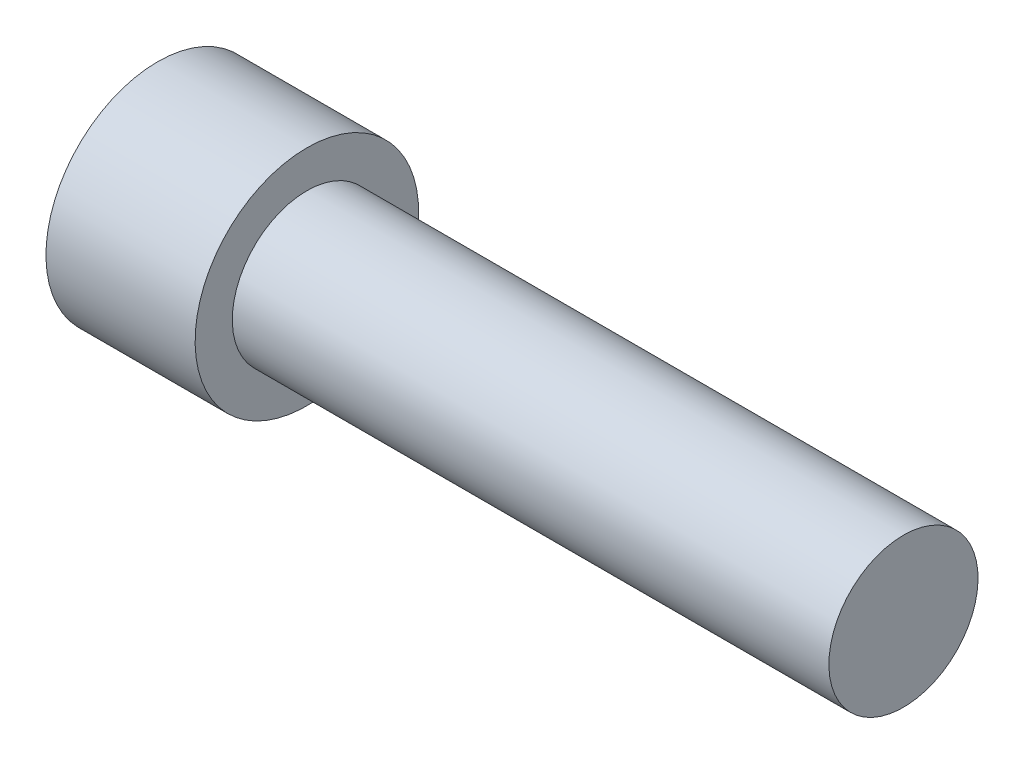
ISO-10303-21;
HEADER;
FILE_DESCRIPTION(('STEP AP214'),'2;1');
FILE_NAME('part.step','',(''),(''),'','','');
FILE_SCHEMA(('AUTOMOTIVE_DESIGN { 1 0 10303 214 1 1 1 1 }'));
ENDSEC;
DATA;
#1=APPLICATION_CONTEXT('core data for automotive mechanical design processes');
#2=APPLICATION_PROTOCOL_DEFINITION('international standard','automotive_design',2000,#1);
#3=PRODUCT_CONTEXT('',#1,'mechanical');
#4=PRODUCT('Part','Part','',(#3));
#5=PRODUCT_RELATED_PRODUCT_CATEGORY('part','',(#4));
#6=PRODUCT_DEFINITION_FORMATION('','',#4);
#7=PRODUCT_DEFINITION_CONTEXT('part definition',#1,'design');
#8=PRODUCT_DEFINITION('design','',#6,#7);
#9=PRODUCT_DEFINITION_SHAPE('','',#8);
#10=(LENGTH_UNIT() NAMED_UNIT(*) SI_UNIT(.MILLI.,.METRE.));
#11=(NAMED_UNIT(*) PLANE_ANGLE_UNIT() SI_UNIT($,.RADIAN.));
#12=(NAMED_UNIT(*) SI_UNIT($,.STERADIAN.) SOLID_ANGLE_UNIT());
#13=UNCERTAINTY_MEASURE_WITH_UNIT(LENGTH_MEASURE(1.E-05),#10,'distance_accuracy_value','');
#14=(GEOMETRIC_REPRESENTATION_CONTEXT(3) GLOBAL_UNCERTAINTY_ASSIGNED_CONTEXT((#13)) GLOBAL_UNIT_ASSIGNED_CONTEXT((#10,
#11,#12)) REPRESENTATION_CONTEXT('',''));
#15=CARTESIAN_POINT('',(0.,0.,0.));
#16=DIRECTION('',(0.,0.,1.));
#17=DIRECTION('',(1.,0.,0.));
#18=AXIS2_PLACEMENT_3D('',#15,#16,#17);
#19=CARTESIAN_POINT('',(47.625,0.,0.));
#20=DIRECTION('',(1.,0.,0.));
#21=DIRECTION('',(0.,1.,0.));
#22=AXIS2_PLACEMENT_3D('',#19,#20,#21);
#23=PLANE('',#22);
#24=CARTESIAN_POINT('',(47.625,0.,0.));
#25=DIRECTION('',(1.,0.,0.));
#26=DIRECTION('',(0.,1.,0.));
#27=AXIS2_PLACEMENT_3D('',#24,#25,#26);
#28=CIRCLE('',#27,4.76250000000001);
#29=CARTESIAN_POINT('',(47.625,4.76250000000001,0.));
#30=VERTEX_POINT('',#29);
#31=EDGE_CURVE('E11',#30,#30,#28,.T.);
#32=ORIENTED_EDGE('',*,*,#31,.T.);
#33=EDGE_LOOP('',(#32));
#34=FACE_BOUND('',#33,.T.);
#35=ADVANCED_FACE('F380',(#34),#23,.T.);
#36=CARTESIAN_POINT('',(47.625,0.,0.));
#37=DIRECTION('',(1.,0.,0.));
#38=DIRECTION('',(0.,1.,0.));
#39=AXIS2_PLACEMENT_3D('',#36,#37,#38);
#40=CYLINDRICAL_SURFACE('',#39,4.7625);
#41=CARTESIAN_POINT('',(9.525,0.,0.));
#42=DIRECTION('',(1.,0.,0.));
#43=DIRECTION('',(0.,1.,0.));
#44=AXIS2_PLACEMENT_3D('',#41,#42,#43);
#45=CIRCLE('',#44,4.7625);
#46=CARTESIAN_POINT('',(9.525,4.7625,0.));
#47=VERTEX_POINT('',#46);
#48=EDGE_CURVE('E387',#47,#47,#45,.T.);
#49=ORIENTED_EDGE('',*,*,#48,.T.);
#50=EDGE_LOOP('',(#49));
#51=FACE_BOUND('',#50,.T.);
#52=ORIENTED_EDGE('',*,*,#31,.F.);
#53=EDGE_LOOP('',(#52));
#54=FACE_BOUND('',#53,.T.);
#55=ADVANCED_FACE('F496',(#51,#54),#40,.T.);
#56=CARTESIAN_POINT('',(9.525,7.1374,0.));
#57=DIRECTION('',(1.,0.,0.));
#58=DIRECTION('',(0.,1.,0.));
#59=AXIS2_PLACEMENT_3D('',#56,#57,#58);
#60=PLANE('',#59);
#61=CARTESIAN_POINT('',(9.525,0.,0.));
#62=DIRECTION('',(1.,0.,0.));
#63=DIRECTION('',(0.,1.,0.));
#64=AXIS2_PLACEMENT_3D('',#61,#62,#63);
#65=CIRCLE('',#64,7.1374);
#66=CARTESIAN_POINT('',(9.525,7.1374,0.));
#67=VERTEX_POINT('',#66);
#68=EDGE_CURVE('E491',#67,#67,#65,.T.);
#69=ORIENTED_EDGE('',*,*,#68,.T.);
#70=EDGE_LOOP('',(#69));
#71=FACE_BOUND('',#70,.T.);
#72=ORIENTED_EDGE('',*,*,#48,.F.);
#73=EDGE_LOOP('',(#72));
#74=FACE_BOUND('',#73,.T.);
#75=ADVANCED_FACE('F499',(#71,#74),#60,.T.);
#76=CARTESIAN_POINT('',(47.625,0.,0.));
#77=DIRECTION('',(1.,0.,0.));
#78=DIRECTION('',(0.,1.,0.));
#79=AXIS2_PLACEMENT_3D('',#76,#77,#78);
#80=CYLINDRICAL_SURFACE('',#79,7.1374);
#81=CARTESIAN_POINT('',(0.,0.,0.));
#82=DIRECTION('',(1.,0.,0.));
#83=DIRECTION('',(0.,1.,0.));
#84=AXIS2_PLACEMENT_3D('',#81,#82,#83);
#85=CIRCLE('',#84,7.1374);
#86=CARTESIAN_POINT('',(0.,7.1374,0.));
#87=VERTEX_POINT('',#86);
#88=EDGE_CURVE('E482',#87,#87,#85,.T.);
#89=ORIENTED_EDGE('',*,*,#88,.T.);
#90=EDGE_LOOP('',(#89));
#91=FACE_BOUND('',#90,.T.);
#92=ORIENTED_EDGE('',*,*,#68,.F.);
#93=EDGE_LOOP('',(#92));
#94=FACE_BOUND('',#93,.T.);
#95=ADVANCED_FACE('F501',(#91,#94),#80,.T.);
#96=CARTESIAN_POINT('',(0.,0.,0.));
#97=DIRECTION('',(-1.,0.,0.));
#98=DIRECTION('',(0.,-1.,0.));
#99=AXIS2_PLACEMENT_3D('',#96,#97,#98);
#100=PLANE('',#99);
#101=DIRECTION('',(0.,0.866025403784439,0.5));
#102=VECTOR('',#101,1.);
#103=CARTESIAN_POINT('',(0.,-3.96875,2.29135888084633));
#104=LINE('',#103,#102);
#105=CARTESIAN_POINT('',(0.,-3.96875,2.29135888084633));
#106=VERTEX_POINT('',#105);
#107=CARTESIAN_POINT('',(0.,0.,4.58271776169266));
#108=VERTEX_POINT('',#107);
#109=EDGE_CURVE('E394',#106,#108,#104,.T.);
#110=ORIENTED_EDGE('',*,*,#109,.F.);
#111=DIRECTION('',(0.,0.,1.));
#112=VECTOR('',#111,1.);
#113=CARTESIAN_POINT('',(0.,-3.96875,-2.29135888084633));
#114=LINE('',#113,#112);
#115=CARTESIAN_POINT('',(0.,-3.96875,-2.29135888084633));
#116=VERTEX_POINT('',#115);
#117=EDGE_CURVE('E464',#116,#106,#114,.T.);
#118=ORIENTED_EDGE('',*,*,#117,.F.);
#119=DIRECTION('',(0.,-0.866025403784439,0.5));
#120=VECTOR('',#119,1.);
#121=CARTESIAN_POINT('',(0.,0.,-4.58271776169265));
#122=LINE('',#121,#120);
#123=CARTESIAN_POINT('',(0.,0.,-4.58271776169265));
#124=VERTEX_POINT('',#123);
#125=EDGE_CURVE('E458',#124,#116,#122,.T.);
#126=ORIENTED_EDGE('',*,*,#125,.F.);
#127=DIRECTION('',(0.,-0.866025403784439,-0.5));
#128=VECTOR('',#127,1.);
#129=CARTESIAN_POINT('',(0.,3.96875,-2.29135888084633));
#130=LINE('',#129,#128);
#131=CARTESIAN_POINT('',(0.,3.96875,-2.29135888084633));
#132=VERTEX_POINT('',#131);
#133=EDGE_CURVE('E456',#132,#124,#130,.T.);
#134=ORIENTED_EDGE('',*,*,#133,.F.);
#135=DIRECTION('',(0.,0.,-1.));
#136=VECTOR('',#135,1.);
#137=CARTESIAN_POINT('',(0.,3.96875,2.29135888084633));
#138=LINE('',#137,#136);
#139=CARTESIAN_POINT('',(0.,3.96875,2.29135888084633));
#140=VERTEX_POINT('',#139);
#141=EDGE_CURVE('E437',#140,#132,#138,.T.);
#142=ORIENTED_EDGE('',*,*,#141,.F.);
#143=DIRECTION('',(0.,0.866025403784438,-0.5));
#144=VECTOR('',#143,1.);
#145=CARTESIAN_POINT('',(0.,0.,4.58271776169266));
#146=LINE('',#145,#144);
#147=EDGE_CURVE('E448',#108,#140,#146,.T.);
#148=ORIENTED_EDGE('',*,*,#147,.F.);
#149=EDGE_LOOP('',(#110,#118,#126,#134,#142,#148));
#150=FACE_BOUND('',#149,.T.);
#151=ORIENTED_EDGE('',*,*,#88,.F.);
#152=EDGE_LOOP('',(#151));
#153=FACE_BOUND('',#152,.T.);
#154=ADVANCED_FACE('F452',(#150,#153),#100,.T.);
#155=CARTESIAN_POINT('',(4.826,-3.96875,2.29135888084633));
#156=DIRECTION('',(0.,-0.5,0.866025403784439));
#157=DIRECTION('',(0.,-0.866025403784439,-0.5));
#158=AXIS2_PLACEMENT_3D('',#155,#156,#157);
#159=PLANE('',#158);
#160=ORIENTED_EDGE('',*,*,#109,.T.);
#161=DIRECTION('',(-1.,0.,0.));
#162=VECTOR('',#161,1.);
#163=CARTESIAN_POINT('',(4.826,0.,4.58271776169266));
#164=LINE('',#163,#162);
#165=CARTESIAN_POINT('',(4.826,0.,4.58271776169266));
#166=VERTEX_POINT('',#165);
#167=EDGE_CURVE('E445',#166,#108,#164,.T.);
#168=ORIENTED_EDGE('',*,*,#167,.F.);
#169=DIRECTION('',(0.,0.866025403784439,0.5));
#170=VECTOR('',#169,1.);
#171=CARTESIAN_POINT('',(4.826,-3.96875,2.29135888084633));
#172=LINE('',#171,#170);
#173=CARTESIAN_POINT('',(4.826,-3.96875,2.29135888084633));
#174=VERTEX_POINT('',#173);
#175=EDGE_CURVE('E466',#174,#166,#172,.T.);
#176=ORIENTED_EDGE('',*,*,#175,.F.);
#177=DIRECTION('',(-1.,0.,0.));
#178=VECTOR('',#177,1.);
#179=CARTESIAN_POINT('',(4.826,-3.96875,2.29135888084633));
#180=LINE('',#179,#178);
#181=EDGE_CURVE('E401',#174,#106,#180,.T.);
#182=ORIENTED_EDGE('',*,*,#181,.T.);
#183=EDGE_LOOP('',(#160,#168,#176,#182));
#184=FACE_BOUND('',#183,.T.);
#185=ADVANCED_FACE('F532',(#184),#159,.F.);
#186=CARTESIAN_POINT('',(4.826,-3.96875,-2.29135888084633));
#187=DIRECTION('',(0.,-1.,0.));
#188=DIRECTION('',(1.,0.,0.));
#189=AXIS2_PLACEMENT_3D('',#186,#187,#188);
#190=PLANE('',#189);
#191=ORIENTED_EDGE('',*,*,#117,.T.);
#192=ORIENTED_EDGE('',*,*,#181,.F.);
#193=DIRECTION('',(0.,0.,1.));
#194=VECTOR('',#193,1.);
#195=CARTESIAN_POINT('',(4.826,-3.96875,-2.29135888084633));
#196=LINE('',#195,#194);
#197=CARTESIAN_POINT('',(4.826,-3.96875,-2.29135888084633));
#198=VERTEX_POINT('',#197);
#199=EDGE_CURVE('E478',#198,#174,#196,.T.);
#200=ORIENTED_EDGE('',*,*,#199,.F.);
#201=DIRECTION('',(-1.,0.,0.));
#202=VECTOR('',#201,1.);
#203=CARTESIAN_POINT('',(4.826,-3.96875,-2.29135888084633));
#204=LINE('',#203,#202);
#205=EDGE_CURVE('E483',#198,#116,#204,.T.);
#206=ORIENTED_EDGE('',*,*,#205,.T.);
#207=EDGE_LOOP('',(#191,#192,#200,#206));
#208=FACE_BOUND('',#207,.T.);
#209=ADVANCED_FACE('F539',(#208),#190,.F.);
#210=CARTESIAN_POINT('',(4.826,0.,-4.58271776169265));
#211=DIRECTION('',(0.,-0.5,-0.866025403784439));
#212=DIRECTION('',(0.,0.866025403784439,-0.5));
#213=AXIS2_PLACEMENT_3D('',#210,#211,#212);
#214=PLANE('',#213);
#215=ORIENTED_EDGE('',*,*,#125,.T.);
#216=ORIENTED_EDGE('',*,*,#205,.F.);
#217=DIRECTION('',(0.,-0.866025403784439,0.5));
#218=VECTOR('',#217,1.);
#219=CARTESIAN_POINT('',(4.826,0.,-4.58271776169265));
#220=LINE('',#219,#218);
#221=CARTESIAN_POINT('',(4.826,0.,-4.58271776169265));
#222=VERTEX_POINT('',#221);
#223=EDGE_CURVE('E475',#222,#198,#220,.T.);
#224=ORIENTED_EDGE('',*,*,#223,.F.);
#225=DIRECTION('',(-1.,0.,0.));
#226=VECTOR('',#225,1.);
#227=CARTESIAN_POINT('',(4.826,0.,-4.58271776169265));
#228=LINE('',#227,#226);
#229=EDGE_CURVE('E485',#222,#124,#228,.T.);
#230=ORIENTED_EDGE('',*,*,#229,.T.);
#231=EDGE_LOOP('',(#215,#216,#224,#230));
#232=FACE_BOUND('',#231,.T.);
#233=ADVANCED_FACE('F546',(#232),#214,.F.);
#234=CARTESIAN_POINT('',(4.826,3.96875,-2.29135888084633));
#235=DIRECTION('',(0.,0.5,-0.866025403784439));
#236=DIRECTION('',(0.,0.866025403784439,0.5));
#237=AXIS2_PLACEMENT_3D('',#234,#235,#236);
#238=PLANE('',#237);
#239=ORIENTED_EDGE('',*,*,#133,.T.);
#240=ORIENTED_EDGE('',*,*,#229,.F.);
#241=DIRECTION('',(0.,-0.866025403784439,-0.5));
#242=VECTOR('',#241,1.);
#243=CARTESIAN_POINT('',(4.826,3.96875,-2.29135888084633));
#244=LINE('',#243,#242);
#245=CARTESIAN_POINT('',(4.826,3.96875,-2.29135888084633));
#246=VERTEX_POINT('',#245);
#247=EDGE_CURVE('E472',#246,#222,#244,.T.);
#248=ORIENTED_EDGE('',*,*,#247,.F.);
#249=DIRECTION('',(-1.,0.,0.));
#250=VECTOR('',#249,1.);
#251=CARTESIAN_POINT('',(4.826,3.96875,-2.29135888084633));
#252=LINE('',#251,#250);
#253=EDGE_CURVE('E444',#246,#132,#252,.T.);
#254=ORIENTED_EDGE('',*,*,#253,.T.);
#255=EDGE_LOOP('',(#239,#240,#248,#254));
#256=FACE_BOUND('',#255,.T.);
#257=ADVANCED_FACE('F553',(#256),#238,.F.);
#258=CARTESIAN_POINT('',(4.826,3.96875,2.29135888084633));
#259=DIRECTION('',(0.,1.,0.));
#260=DIRECTION('',(-1.,0.,0.));
#261=AXIS2_PLACEMENT_3D('',#258,#259,#260);
#262=PLANE('',#261);
#263=ORIENTED_EDGE('',*,*,#141,.T.);
#264=ORIENTED_EDGE('',*,*,#253,.F.);
#265=DIRECTION('',(0.,0.,-1.));
#266=VECTOR('',#265,1.);
#267=CARTESIAN_POINT('',(4.826,3.96875,2.29135888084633));
#268=LINE('',#267,#266);
#269=CARTESIAN_POINT('',(4.826,3.96875,2.29135888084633));
#270=VERTEX_POINT('',#269);
#271=EDGE_CURVE('E440',#270,#246,#268,.T.);
#272=ORIENTED_EDGE('',*,*,#271,.F.);
#273=DIRECTION('',(-1.,0.,0.));
#274=VECTOR('',#273,1.);
#275=CARTESIAN_POINT('',(4.826,3.96875,2.29135888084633));
#276=LINE('',#275,#274);
#277=EDGE_CURVE('E433',#270,#140,#276,.T.);
#278=ORIENTED_EDGE('',*,*,#277,.T.);
#279=EDGE_LOOP('',(#263,#264,#272,#278));
#280=FACE_BOUND('',#279,.T.);
#281=ADVANCED_FACE('F435',(#280),#262,.F.);
#282=CARTESIAN_POINT('',(4.826,0.,4.58271776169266));
#283=DIRECTION('',(0.,0.5,0.866025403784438));
#284=DIRECTION('',(0.,-0.866025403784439,0.5));
#285=AXIS2_PLACEMENT_3D('',#282,#283,#284);
#286=PLANE('',#285);
#287=ORIENTED_EDGE('',*,*,#147,.T.);
#288=ORIENTED_EDGE('',*,*,#277,.F.);
#289=DIRECTION('',(0.,0.866025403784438,-0.5));
#290=VECTOR('',#289,1.);
#291=CARTESIAN_POINT('',(4.826,0.,4.58271776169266));
#292=LINE('',#291,#290);
#293=EDGE_CURVE('E469',#166,#270,#292,.T.);
#294=ORIENTED_EDGE('',*,*,#293,.F.);
#295=ORIENTED_EDGE('',*,*,#167,.T.);
#296=EDGE_LOOP('',(#287,#288,#294,#295));
#297=FACE_BOUND('',#296,.T.);
#298=ADVANCED_FACE('F449',(#297),#286,.F.);
#299=CARTESIAN_POINT('',(4.826,3.96875,6.87407664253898));
#300=DIRECTION('',(-1.,0.,0.));
#301=DIRECTION('',(0.,-1.,0.));
#302=AXIS2_PLACEMENT_3D('',#299,#300,#301);
#303=PLANE('',#302);
#304=ORIENTED_EDGE('',*,*,#175,.T.);
#305=ORIENTED_EDGE('',*,*,#293,.T.);
#306=ORIENTED_EDGE('',*,*,#271,.T.);
#307=ORIENTED_EDGE('',*,*,#247,.T.);
#308=ORIENTED_EDGE('',*,*,#223,.T.);
#309=ORIENTED_EDGE('',*,*,#199,.T.);
#310=EDGE_LOOP('',(#304,#305,#306,#307,#308,#309));
#311=FACE_BOUND('',#310,.T.);
#312=ADVANCED_FACE('F574',(#311),#303,.T.);
#313=CLOSED_SHELL('',(#35,#55,#75,#95,#154,#185,#209,#233,#257,#281,#298,#312));
#314=MANIFOLD_SOLID_BREP('B2',#313);
#315=ADVANCED_BREP_SHAPE_REPRESENTATION('',(#18,#314),#14);
#316=SHAPE_DEFINITION_REPRESENTATION(#9,#315);
ENDSEC;
END-ISO-10303-21;
